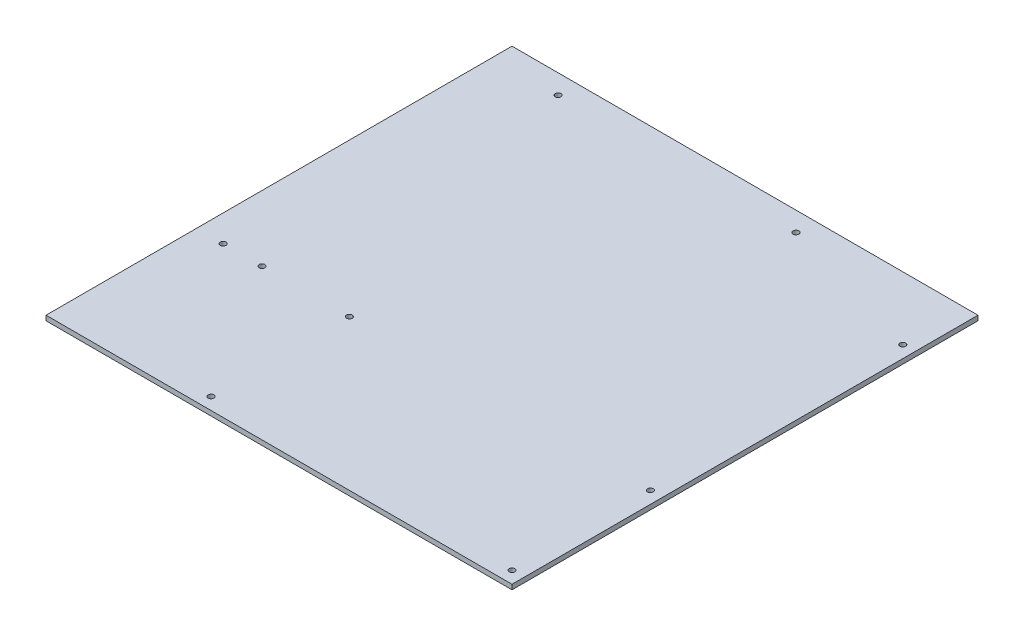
ISO-10303-21;
HEADER;
FILE_DESCRIPTION(('STEP AP214'),'2;1');
FILE_NAME('part.step','',(''),(''),'','','');
FILE_SCHEMA(('AUTOMOTIVE_DESIGN { 1 0 10303 214 1 1 1 1 }'));
ENDSEC;
DATA;
#1=APPLICATION_CONTEXT('core data for automotive mechanical design processes');
#2=APPLICATION_PROTOCOL_DEFINITION('international standard','automotive_design',2000,#1);
#3=PRODUCT_CONTEXT('',#1,'mechanical');
#4=PRODUCT('Part','Part','',(#3));
#5=PRODUCT_RELATED_PRODUCT_CATEGORY('part','',(#4));
#6=PRODUCT_DEFINITION_FORMATION('','',#4);
#7=PRODUCT_DEFINITION_CONTEXT('part definition',#1,'design');
#8=PRODUCT_DEFINITION('design','',#6,#7);
#9=PRODUCT_DEFINITION_SHAPE('','',#8);
#10=(LENGTH_UNIT() NAMED_UNIT(*) SI_UNIT(.MILLI.,.METRE.));
#11=(NAMED_UNIT(*) PLANE_ANGLE_UNIT() SI_UNIT($,.RADIAN.));
#12=(NAMED_UNIT(*) SI_UNIT($,.STERADIAN.) SOLID_ANGLE_UNIT());
#13=UNCERTAINTY_MEASURE_WITH_UNIT(LENGTH_MEASURE(1.E-05),#10,'distance_accuracy_value','');
#14=(GEOMETRIC_REPRESENTATION_CONTEXT(3) GLOBAL_UNCERTAINTY_ASSIGNED_CONTEXT((#13)) GLOBAL_UNIT_ASSIGNED_CONTEXT((#10,
#11,#12)) REPRESENTATION_CONTEXT('',''));
#15=CARTESIAN_POINT('',(0.,0.,0.));
#16=DIRECTION('',(0.,0.,1.));
#17=DIRECTION('',(1.,0.,0.));
#18=AXIS2_PLACEMENT_3D('',#15,#16,#17);
#19=CARTESIAN_POINT('',(-121.92,2.54,0.));
#20=DIRECTION('',(1.,0.,0.));
#21=DIRECTION('',(0.,0.,-1.));
#22=AXIS2_PLACEMENT_3D('',#19,#20,#21);
#23=PLANE('',#22);
#24=DIRECTION('',(0.,0.,1.));
#25=VECTOR('',#24,1.);
#26=CARTESIAN_POINT('',(-121.92,0.,0.));
#27=LINE('',#26,#25);
#28=CARTESIAN_POINT('',(-121.92,0.,-243.84));
#29=VERTEX_POINT('',#28);
#30=CARTESIAN_POINT('',(-121.92,0.,0.));
#31=VERTEX_POINT('',#30);
#32=EDGE_CURVE('E95',#29,#31,#27,.T.);
#33=ORIENTED_EDGE('',*,*,#32,.T.);
#34=DIRECTION('',(0.,-1.,0.));
#35=VECTOR('',#34,1.);
#36=CARTESIAN_POINT('',(-121.92,2.54,0.));
#37=LINE('',#36,#35);
#38=CARTESIAN_POINT('',(-121.92,2.54,0.));
#39=VERTEX_POINT('',#38);
#40=EDGE_CURVE('E11',#39,#31,#37,.T.);
#41=ORIENTED_EDGE('',*,*,#40,.F.);
#42=DIRECTION('',(0.,0.,1.));
#43=VECTOR('',#42,1.);
#44=CARTESIAN_POINT('',(-121.92,2.54,0.));
#45=LINE('',#44,#43);
#46=CARTESIAN_POINT('',(-121.92,2.54,-243.84));
#47=VERTEX_POINT('',#46);
#48=EDGE_CURVE('E83',#47,#39,#45,.T.);
#49=ORIENTED_EDGE('',*,*,#48,.F.);
#50=DIRECTION('',(0.,-1.,0.));
#51=VECTOR('',#50,1.);
#52=CARTESIAN_POINT('',(-121.92,2.54,-243.84));
#53=LINE('',#52,#51);
#54=EDGE_CURVE('E91',#47,#29,#53,.T.);
#55=ORIENTED_EDGE('',*,*,#54,.T.);
#56=EDGE_LOOP('',(#33,#41,#49,#55));
#57=FACE_BOUND('',#56,.T.);
#58=ADVANCED_FACE('F32',(#57),#23,.F.);
#59=CARTESIAN_POINT('',(-121.92,2.54,0.));
#60=DIRECTION('',(0.,0.,-1.));
#61=DIRECTION('',(-1.,0.,0.));
#62=AXIS2_PLACEMENT_3D('',#59,#60,#61);
#63=PLANE('',#62);
#64=DIRECTION('',(1.,0.,0.));
#65=VECTOR('',#64,1.);
#66=CARTESIAN_POINT('',(-121.92,0.,0.));
#67=LINE('',#66,#65);
#68=CARTESIAN_POINT('',(121.92,0.,0.));
#69=VERTEX_POINT('',#68);
#70=EDGE_CURVE('E87',#31,#69,#67,.T.);
#71=ORIENTED_EDGE('',*,*,#70,.T.);
#72=DIRECTION('',(0.,-1.,0.));
#73=VECTOR('',#72,1.);
#74=CARTESIAN_POINT('',(121.92,2.54,0.));
#75=LINE('',#74,#73);
#76=CARTESIAN_POINT('',(121.92,2.54,0.));
#77=VERTEX_POINT('',#76);
#78=EDGE_CURVE('E40',#77,#69,#75,.T.);
#79=ORIENTED_EDGE('',*,*,#78,.F.);
#80=DIRECTION('',(1.,0.,0.));
#81=VECTOR('',#80,1.);
#82=CARTESIAN_POINT('',(-121.92,2.54,0.));
#83=LINE('',#82,#81);
#84=EDGE_CURVE('E78',#39,#77,#83,.T.);
#85=ORIENTED_EDGE('',*,*,#84,.F.);
#86=ORIENTED_EDGE('',*,*,#40,.T.);
#87=EDGE_LOOP('',(#71,#79,#85,#86));
#88=FACE_BOUND('',#87,.T.);
#89=ADVANCED_FACE('F86',(#88),#63,.F.);
#90=CARTESIAN_POINT('',(121.92,2.54,0.));
#91=DIRECTION('',(-1.,0.,0.));
#92=DIRECTION('',(0.,0.,1.));
#93=AXIS2_PLACEMENT_3D('',#90,#91,#92);
#94=PLANE('',#93);
#95=DIRECTION('',(0.,0.,-1.));
#96=VECTOR('',#95,1.);
#97=CARTESIAN_POINT('',(121.92,0.,0.));
#98=LINE('',#97,#96);
#99=CARTESIAN_POINT('',(121.92,0.,-243.84));
#100=VERTEX_POINT('',#99);
#101=EDGE_CURVE('E65',#69,#100,#98,.T.);
#102=ORIENTED_EDGE('',*,*,#101,.T.);
#103=DIRECTION('',(0.,-1.,0.));
#104=VECTOR('',#103,1.);
#105=CARTESIAN_POINT('',(121.92,2.54,-243.84));
#106=LINE('',#105,#104);
#107=CARTESIAN_POINT('',(121.92,2.54,-243.84));
#108=VERTEX_POINT('',#107);
#109=EDGE_CURVE('E88',#108,#100,#106,.T.);
#110=ORIENTED_EDGE('',*,*,#109,.F.);
#111=DIRECTION('',(0.,0.,-1.));
#112=VECTOR('',#111,1.);
#113=CARTESIAN_POINT('',(121.92,2.54,0.));
#114=LINE('',#113,#112);
#115=EDGE_CURVE('E81',#77,#108,#114,.T.);
#116=ORIENTED_EDGE('',*,*,#115,.F.);
#117=ORIENTED_EDGE('',*,*,#78,.T.);
#118=EDGE_LOOP('',(#102,#110,#116,#117));
#119=FACE_BOUND('',#118,.T.);
#120=ADVANCED_FACE('F89',(#119),#94,.F.);
#121=CARTESIAN_POINT('',(-121.92,2.54,-243.84));
#122=DIRECTION('',(0.,0.,1.));
#123=DIRECTION('',(1.,0.,0.));
#124=AXIS2_PLACEMENT_3D('',#121,#122,#123);
#125=PLANE('',#124);
#126=DIRECTION('',(-1.,0.,0.));
#127=VECTOR('',#126,1.);
#128=CARTESIAN_POINT('',(-121.92,0.,-243.84));
#129=LINE('',#128,#127);
#130=EDGE_CURVE('E71',#100,#29,#129,.T.);
#131=ORIENTED_EDGE('',*,*,#130,.T.);
#132=ORIENTED_EDGE('',*,*,#54,.F.);
#133=DIRECTION('',(-1.,0.,0.));
#134=VECTOR('',#133,1.);
#135=CARTESIAN_POINT('',(-121.92,2.54,-243.84));
#136=LINE('',#135,#134);
#137=EDGE_CURVE('E48',#108,#47,#136,.T.);
#138=ORIENTED_EDGE('',*,*,#137,.F.);
#139=ORIENTED_EDGE('',*,*,#109,.T.);
#140=EDGE_LOOP('',(#131,#132,#138,#139));
#141=FACE_BOUND('',#140,.T.);
#142=ADVANCED_FACE('F103',(#141),#125,.F.);
#143=CARTESIAN_POINT('',(0.,2.54,0.));
#144=DIRECTION('',(0.,-1.,0.));
#145=DIRECTION('',(0.,0.,-1.));
#146=AXIS2_PLACEMENT_3D('',#143,#144,#145);
#147=PLANE('',#146);
#148=CARTESIAN_POINT('',(-87.63,2.54,-233.68));
#149=DIRECTION('',(0.,1.,0.));
#150=DIRECTION('',(0.,0.,1.));
#151=AXIS2_PLACEMENT_3D('',#148,#149,#150);
#152=CIRCLE('',#151,1.5);
#153=CARTESIAN_POINT('',(-87.63,2.54,-232.18));
#154=VERTEX_POINT('',#153);
#155=EDGE_CURVE('E159',#154,#154,#152,.T.);
#156=ORIENTED_EDGE('',*,*,#155,.F.);
#157=EDGE_LOOP('',(#156));
#158=FACE_BOUND('',#157,.T.);
#159=CARTESIAN_POINT('',(-41.91,2.54,-6.35));
#160=DIRECTION('',(0.,1.,0.));
#161=DIRECTION('',(0.,0.,1.));
#162=AXIS2_PLACEMENT_3D('',#159,#160,#161);
#163=CIRCLE('',#162,1.5);
#164=CARTESIAN_POINT('',(-41.91,2.54,-4.85));
#165=VERTEX_POINT('',#164);
#166=EDGE_CURVE('E153',#165,#165,#163,.T.);
#167=ORIENTED_EDGE('',*,*,#166,.F.);
#168=EDGE_LOOP('',(#167));
#169=FACE_BOUND('',#168,.T.);
#170=CARTESIAN_POINT('',(36.83,2.54,-233.68));
#171=DIRECTION('',(0.,1.,0.));
#172=DIRECTION('',(0.,0.,1.));
#173=AXIS2_PLACEMENT_3D('',#170,#171,#172);
#174=CIRCLE('',#173,1.5);
#175=CARTESIAN_POINT('',(36.83,2.54,-232.18));
#176=VERTEX_POINT('',#175);
#177=EDGE_CURVE('E147',#176,#176,#174,.T.);
#178=ORIENTED_EDGE('',*,*,#177,.F.);
#179=EDGE_LOOP('',(#178));
#180=FACE_BOUND('',#179,.T.);
#181=CARTESIAN_POINT('',(115.57,2.54,-210.82));
#182=DIRECTION('',(0.,1.,0.));
#183=DIRECTION('',(0.,0.,1.));
#184=AXIS2_PLACEMENT_3D('',#181,#182,#183);
#185=CIRCLE('',#184,1.5);
#186=CARTESIAN_POINT('',(115.57,2.54,-209.32));
#187=VERTEX_POINT('',#186);
#188=EDGE_CURVE('E141',#187,#187,#185,.T.);
#189=ORIENTED_EDGE('',*,*,#188,.F.);
#190=EDGE_LOOP('',(#189));
#191=FACE_BOUND('',#190,.T.);
#192=CARTESIAN_POINT('',(-107.95,2.54,-78.74));
#193=DIRECTION('',(0.,1.,0.));
#194=DIRECTION('',(0.,0.,1.));
#195=AXIS2_PLACEMENT_3D('',#192,#193,#194);
#196=CIRCLE('',#195,1.5);
#197=CARTESIAN_POINT('',(-107.95,2.54,-77.24));
#198=VERTEX_POINT('',#197);
#199=EDGE_CURVE('E135',#198,#198,#196,.T.);
#200=ORIENTED_EDGE('',*,*,#199,.F.);
#201=EDGE_LOOP('',(#200));
#202=FACE_BOUND('',#201,.T.);
#203=CARTESIAN_POINT('',(-87.63,2.54,-78.74));
#204=DIRECTION('',(0.,1.,0.));
#205=DIRECTION('',(0.,0.,1.));
#206=AXIS2_PLACEMENT_3D('',#203,#204,#205);
#207=CIRCLE('',#206,1.5);
#208=CARTESIAN_POINT('',(-87.63,2.54,-77.24));
#209=VERTEX_POINT('',#208);
#210=EDGE_CURVE('E129',#209,#209,#207,.T.);
#211=ORIENTED_EDGE('',*,*,#210,.F.);
#212=EDGE_LOOP('',(#211));
#213=FACE_BOUND('',#212,.T.);
#214=CARTESIAN_POINT('',(-41.91,2.54,-78.74));
#215=DIRECTION('',(0.,1.,0.));
#216=DIRECTION('',(0.,0.,1.));
#217=AXIS2_PLACEMENT_3D('',#214,#215,#216);
#218=CIRCLE('',#217,1.5);
#219=CARTESIAN_POINT('',(-41.91,2.54,-77.24));
#220=VERTEX_POINT('',#219);
#221=EDGE_CURVE('E123',#220,#220,#218,.T.);
#222=ORIENTED_EDGE('',*,*,#221,.F.);
#223=EDGE_LOOP('',(#222));
#224=FACE_BOUND('',#223,.T.);
#225=CARTESIAN_POINT('',(115.57,2.54,-6.35));
#226=DIRECTION('',(0.,1.,0.));
#227=DIRECTION('',(0.,0.,1.));
#228=AXIS2_PLACEMENT_3D('',#225,#226,#227);
#229=CIRCLE('',#228,1.5);
#230=CARTESIAN_POINT('',(115.57,2.54,-4.85));
#231=VERTEX_POINT('',#230);
#232=EDGE_CURVE('E117',#231,#231,#229,.T.);
#233=ORIENTED_EDGE('',*,*,#232,.F.);
#234=EDGE_LOOP('',(#233));
#235=FACE_BOUND('',#234,.T.);
#236=CARTESIAN_POINT('',(115.57,2.54,-78.74));
#237=DIRECTION('',(0.,1.,0.));
#238=DIRECTION('',(0.,0.,1.));
#239=AXIS2_PLACEMENT_3D('',#236,#237,#238);
#240=CIRCLE('',#239,1.5);
#241=CARTESIAN_POINT('',(115.57,2.54,-77.24));
#242=VERTEX_POINT('',#241);
#243=EDGE_CURVE('E111',#242,#242,#240,.T.);
#244=ORIENTED_EDGE('',*,*,#243,.F.);
#245=EDGE_LOOP('',(#244));
#246=FACE_BOUND('',#245,.T.);
#247=ORIENTED_EDGE('',*,*,#48,.T.);
#248=ORIENTED_EDGE('',*,*,#84,.T.);
#249=ORIENTED_EDGE('',*,*,#115,.T.);
#250=ORIENTED_EDGE('',*,*,#137,.T.);
#251=EDGE_LOOP('',(#247,#248,#249,#250));
#252=FACE_BOUND('',#251,.T.);
#253=ADVANCED_FACE('F79',(#158,#169,#180,#191,#202,#213,#224,#235,#246,#252),#147,.F.);
#254=CARTESIAN_POINT('',(0.,0.,0.));
#255=DIRECTION('',(0.,-1.,0.));
#256=DIRECTION('',(0.,0.,-1.));
#257=AXIS2_PLACEMENT_3D('',#254,#255,#256);
#258=PLANE('',#257);
#259=CARTESIAN_POINT('',(-87.63,0.,-233.68));
#260=DIRECTION('',(0.,-1.,0.));
#261=DIRECTION('',(0.,0.,-1.));
#262=AXIS2_PLACEMENT_3D('',#259,#260,#261);
#263=CIRCLE('',#262,1.5);
#264=CARTESIAN_POINT('',(-87.63,0.,-235.18));
#265=VERTEX_POINT('',#264);
#266=EDGE_CURVE('E156',#265,#265,#263,.T.);
#267=ORIENTED_EDGE('',*,*,#266,.F.);
#268=EDGE_LOOP('',(#267));
#269=FACE_BOUND('',#268,.T.);
#270=CARTESIAN_POINT('',(-41.91,0.,-6.35));
#271=DIRECTION('',(0.,-1.,0.));
#272=DIRECTION('',(0.,0.,-1.));
#273=AXIS2_PLACEMENT_3D('',#270,#271,#272);
#274=CIRCLE('',#273,1.5);
#275=CARTESIAN_POINT('',(-41.91,0.,-7.85));
#276=VERTEX_POINT('',#275);
#277=EDGE_CURVE('E150',#276,#276,#274,.T.);
#278=ORIENTED_EDGE('',*,*,#277,.F.);
#279=EDGE_LOOP('',(#278));
#280=FACE_BOUND('',#279,.T.);
#281=CARTESIAN_POINT('',(36.83,0.,-233.68));
#282=DIRECTION('',(0.,-1.,0.));
#283=DIRECTION('',(0.,0.,-1.));
#284=AXIS2_PLACEMENT_3D('',#281,#282,#283);
#285=CIRCLE('',#284,1.5);
#286=CARTESIAN_POINT('',(36.83,0.,-235.18));
#287=VERTEX_POINT('',#286);
#288=EDGE_CURVE('E144',#287,#287,#285,.T.);
#289=ORIENTED_EDGE('',*,*,#288,.F.);
#290=EDGE_LOOP('',(#289));
#291=FACE_BOUND('',#290,.T.);
#292=CARTESIAN_POINT('',(115.57,0.,-210.82));
#293=DIRECTION('',(0.,-1.,0.));
#294=DIRECTION('',(0.,0.,-1.));
#295=AXIS2_PLACEMENT_3D('',#292,#293,#294);
#296=CIRCLE('',#295,1.5);
#297=CARTESIAN_POINT('',(115.57,0.,-212.32));
#298=VERTEX_POINT('',#297);
#299=EDGE_CURVE('E138',#298,#298,#296,.T.);
#300=ORIENTED_EDGE('',*,*,#299,.F.);
#301=EDGE_LOOP('',(#300));
#302=FACE_BOUND('',#301,.T.);
#303=CARTESIAN_POINT('',(-107.95,0.,-78.74));
#304=DIRECTION('',(0.,-1.,0.));
#305=DIRECTION('',(0.,0.,-1.));
#306=AXIS2_PLACEMENT_3D('',#303,#304,#305);
#307=CIRCLE('',#306,1.5);
#308=CARTESIAN_POINT('',(-107.95,0.,-80.24));
#309=VERTEX_POINT('',#308);
#310=EDGE_CURVE('E132',#309,#309,#307,.T.);
#311=ORIENTED_EDGE('',*,*,#310,.F.);
#312=EDGE_LOOP('',(#311));
#313=FACE_BOUND('',#312,.T.);
#314=CARTESIAN_POINT('',(-87.63,0.,-78.74));
#315=DIRECTION('',(0.,-1.,0.));
#316=DIRECTION('',(0.,0.,-1.));
#317=AXIS2_PLACEMENT_3D('',#314,#315,#316);
#318=CIRCLE('',#317,1.5);
#319=CARTESIAN_POINT('',(-87.63,0.,-80.24));
#320=VERTEX_POINT('',#319);
#321=EDGE_CURVE('E126',#320,#320,#318,.T.);
#322=ORIENTED_EDGE('',*,*,#321,.F.);
#323=EDGE_LOOP('',(#322));
#324=FACE_BOUND('',#323,.T.);
#325=CARTESIAN_POINT('',(-41.91,0.,-78.74));
#326=DIRECTION('',(0.,-1.,0.));
#327=DIRECTION('',(0.,0.,-1.));
#328=AXIS2_PLACEMENT_3D('',#325,#326,#327);
#329=CIRCLE('',#328,1.5);
#330=CARTESIAN_POINT('',(-41.91,0.,-80.24));
#331=VERTEX_POINT('',#330);
#332=EDGE_CURVE('E120',#331,#331,#329,.T.);
#333=ORIENTED_EDGE('',*,*,#332,.F.);
#334=EDGE_LOOP('',(#333));
#335=FACE_BOUND('',#334,.T.);
#336=CARTESIAN_POINT('',(115.57,0.,-6.35));
#337=DIRECTION('',(0.,-1.,0.));
#338=DIRECTION('',(0.,0.,-1.));
#339=AXIS2_PLACEMENT_3D('',#336,#337,#338);
#340=CIRCLE('',#339,1.5);
#341=CARTESIAN_POINT('',(115.57,0.,-7.85));
#342=VERTEX_POINT('',#341);
#343=EDGE_CURVE('E114',#342,#342,#340,.T.);
#344=ORIENTED_EDGE('',*,*,#343,.F.);
#345=EDGE_LOOP('',(#344));
#346=FACE_BOUND('',#345,.T.);
#347=CARTESIAN_POINT('',(115.57,0.,-78.74));
#348=DIRECTION('',(0.,-1.,0.));
#349=DIRECTION('',(0.,0.,-1.));
#350=AXIS2_PLACEMENT_3D('',#347,#348,#349);
#351=CIRCLE('',#350,1.5);
#352=CARTESIAN_POINT('',(115.57,0.,-80.24));
#353=VERTEX_POINT('',#352);
#354=EDGE_CURVE('E98',#353,#353,#351,.T.);
#355=ORIENTED_EDGE('',*,*,#354,.F.);
#356=EDGE_LOOP('',(#355));
#357=FACE_BOUND('',#356,.T.);
#358=ORIENTED_EDGE('',*,*,#32,.F.);
#359=ORIENTED_EDGE('',*,*,#130,.F.);
#360=ORIENTED_EDGE('',*,*,#101,.F.);
#361=ORIENTED_EDGE('',*,*,#70,.F.);
#362=EDGE_LOOP('',(#358,#359,#360,#361));
#363=FACE_BOUND('',#362,.T.);
#364=ADVANCED_FACE('F106',(#269,#280,#291,#302,#313,#324,#335,#346,#357,#363),#258,.T.);
#365=CARTESIAN_POINT('',(115.57,2.54,-78.74));
#366=DIRECTION('',(0.,1.,0.));
#367=DIRECTION('',(0.,0.,1.));
#368=AXIS2_PLACEMENT_3D('',#365,#366,#367);
#369=CYLINDRICAL_SURFACE('',#368,1.5);
#370=ORIENTED_EDGE('',*,*,#354,.T.);
#371=EDGE_LOOP('',(#370));
#372=FACE_BOUND('',#371,.T.);
#373=ORIENTED_EDGE('',*,*,#243,.T.);
#374=EDGE_LOOP('',(#373));
#375=FACE_BOUND('',#374,.T.);
#376=ADVANCED_FACE('F184',(#372,#375),#369,.F.);
#377=CARTESIAN_POINT('',(115.57,2.54,-6.35));
#378=DIRECTION('',(0.,1.,0.));
#379=DIRECTION('',(0.,0.,1.));
#380=AXIS2_PLACEMENT_3D('',#377,#378,#379);
#381=CYLINDRICAL_SURFACE('',#380,1.5);
#382=ORIENTED_EDGE('',*,*,#343,.T.);
#383=EDGE_LOOP('',(#382));
#384=FACE_BOUND('',#383,.T.);
#385=ORIENTED_EDGE('',*,*,#232,.T.);
#386=EDGE_LOOP('',(#385));
#387=FACE_BOUND('',#386,.T.);
#388=ADVANCED_FACE('F186',(#384,#387),#381,.F.);
#389=CARTESIAN_POINT('',(-41.91,2.54,-78.74));
#390=DIRECTION('',(0.,1.,0.));
#391=DIRECTION('',(0.,0.,1.));
#392=AXIS2_PLACEMENT_3D('',#389,#390,#391);
#393=CYLINDRICAL_SURFACE('',#392,1.5);
#394=ORIENTED_EDGE('',*,*,#332,.T.);
#395=EDGE_LOOP('',(#394));
#396=FACE_BOUND('',#395,.T.);
#397=ORIENTED_EDGE('',*,*,#221,.T.);
#398=EDGE_LOOP('',(#397));
#399=FACE_BOUND('',#398,.T.);
#400=ADVANCED_FACE('F193',(#396,#399),#393,.F.);
#401=CARTESIAN_POINT('',(-87.63,2.54,-78.74));
#402=DIRECTION('',(0.,1.,0.));
#403=DIRECTION('',(0.,0.,1.));
#404=AXIS2_PLACEMENT_3D('',#401,#402,#403);
#405=CYLINDRICAL_SURFACE('',#404,1.5);
#406=ORIENTED_EDGE('',*,*,#321,.T.);
#407=EDGE_LOOP('',(#406));
#408=FACE_BOUND('',#407,.T.);
#409=ORIENTED_EDGE('',*,*,#210,.T.);
#410=EDGE_LOOP('',(#409));
#411=FACE_BOUND('',#410,.T.);
#412=ADVANCED_FACE('F239',(#408,#411),#405,.F.);
#413=CARTESIAN_POINT('',(-107.95,2.54,-78.74));
#414=DIRECTION('',(0.,1.,0.));
#415=DIRECTION('',(0.,0.,1.));
#416=AXIS2_PLACEMENT_3D('',#413,#414,#415);
#417=CYLINDRICAL_SURFACE('',#416,1.5);
#418=ORIENTED_EDGE('',*,*,#310,.T.);
#419=EDGE_LOOP('',(#418));
#420=FACE_BOUND('',#419,.T.);
#421=ORIENTED_EDGE('',*,*,#199,.T.);
#422=EDGE_LOOP('',(#421));
#423=FACE_BOUND('',#422,.T.);
#424=ADVANCED_FACE('F249',(#420,#423),#417,.F.);
#425=CARTESIAN_POINT('',(115.57,2.54,-210.82));
#426=DIRECTION('',(0.,1.,0.));
#427=DIRECTION('',(0.,0.,1.));
#428=AXIS2_PLACEMENT_3D('',#425,#426,#427);
#429=CYLINDRICAL_SURFACE('',#428,1.5);
#430=ORIENTED_EDGE('',*,*,#299,.T.);
#431=EDGE_LOOP('',(#430));
#432=FACE_BOUND('',#431,.T.);
#433=ORIENTED_EDGE('',*,*,#188,.T.);
#434=EDGE_LOOP('',(#433));
#435=FACE_BOUND('',#434,.T.);
#436=ADVANCED_FACE('F259',(#432,#435),#429,.F.);
#437=CARTESIAN_POINT('',(36.83,2.54,-233.68));
#438=DIRECTION('',(0.,1.,0.));
#439=DIRECTION('',(0.,0.,1.));
#440=AXIS2_PLACEMENT_3D('',#437,#438,#439);
#441=CYLINDRICAL_SURFACE('',#440,1.5);
#442=ORIENTED_EDGE('',*,*,#288,.T.);
#443=EDGE_LOOP('',(#442));
#444=FACE_BOUND('',#443,.T.);
#445=ORIENTED_EDGE('',*,*,#177,.T.);
#446=EDGE_LOOP('',(#445));
#447=FACE_BOUND('',#446,.T.);
#448=ADVANCED_FACE('F269',(#444,#447),#441,.F.);
#449=CARTESIAN_POINT('',(-41.91,2.54,-6.35));
#450=DIRECTION('',(0.,1.,0.));
#451=DIRECTION('',(0.,0.,1.));
#452=AXIS2_PLACEMENT_3D('',#449,#450,#451);
#453=CYLINDRICAL_SURFACE('',#452,1.5);
#454=ORIENTED_EDGE('',*,*,#277,.T.);
#455=EDGE_LOOP('',(#454));
#456=FACE_BOUND('',#455,.T.);
#457=ORIENTED_EDGE('',*,*,#166,.T.);
#458=EDGE_LOOP('',(#457));
#459=FACE_BOUND('',#458,.T.);
#460=ADVANCED_FACE('F279',(#456,#459),#453,.F.);
#461=CARTESIAN_POINT('',(-87.63,2.54,-233.68));
#462=DIRECTION('',(0.,1.,0.));
#463=DIRECTION('',(0.,0.,1.));
#464=AXIS2_PLACEMENT_3D('',#461,#462,#463);
#465=CYLINDRICAL_SURFACE('',#464,1.5);
#466=ORIENTED_EDGE('',*,*,#266,.T.);
#467=EDGE_LOOP('',(#466));
#468=FACE_BOUND('',#467,.T.);
#469=ORIENTED_EDGE('',*,*,#155,.T.);
#470=EDGE_LOOP('',(#469));
#471=FACE_BOUND('',#470,.T.);
#472=ADVANCED_FACE('F163',(#468,#471),#465,.F.);
#473=CLOSED_SHELL('',(#58,#89,#120,#142,#253,#364,#376,#388,#400,#412,#424,#436,#448,#460,#472));
#474=MANIFOLD_SOLID_BREP('B2',#473);
#475=ADVANCED_BREP_SHAPE_REPRESENTATION('',(#18,#474),#14);
#476=SHAPE_DEFINITION_REPRESENTATION(#9,#475);
ENDSEC;
END-ISO-10303-21;
